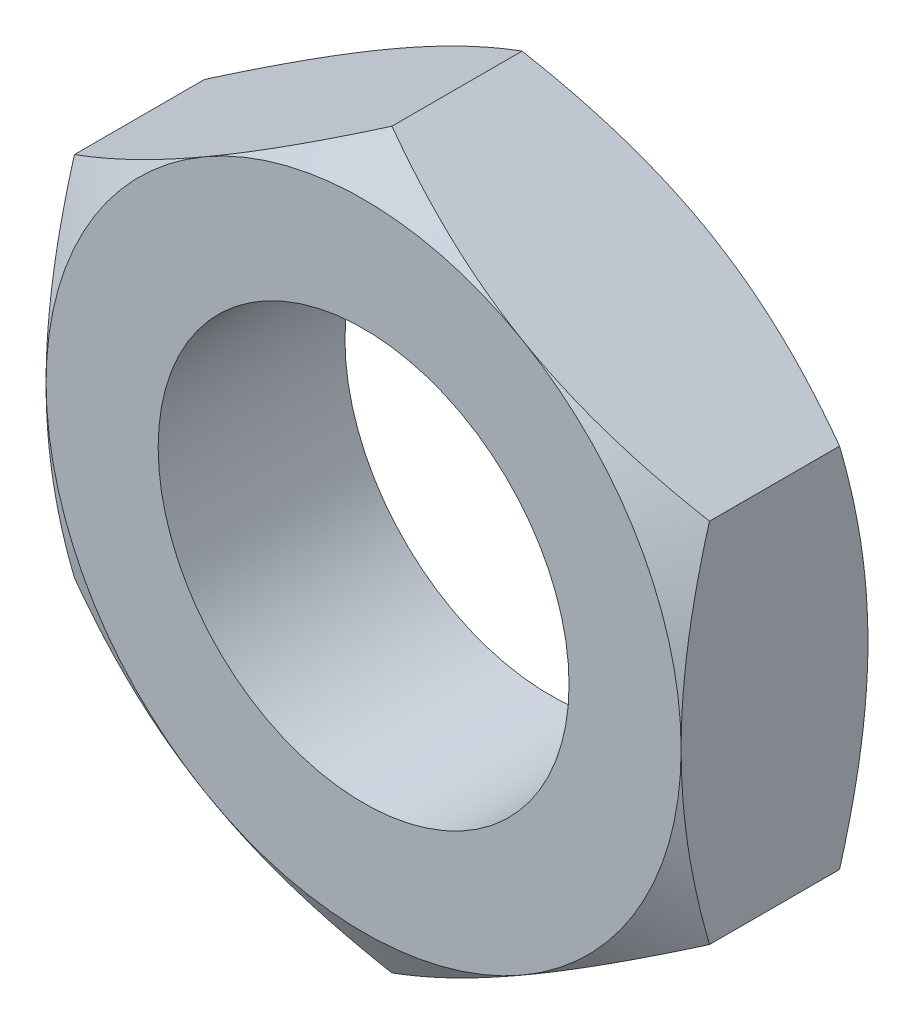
ISO-10303-21;
HEADER;
FILE_DESCRIPTION(('STEP AP214'),'2;1');
FILE_NAME('part.step','',(''),(''),'','','');
FILE_SCHEMA(('AUTOMOTIVE_DESIGN { 1 0 10303 214 1 1 1 1 }'));
ENDSEC;
DATA;
#1=APPLICATION_CONTEXT('core data for automotive mechanical design processes');
#2=APPLICATION_PROTOCOL_DEFINITION('international standard','automotive_design',2000,#1);
#3=PRODUCT_CONTEXT('',#1,'mechanical');
#4=PRODUCT('Part','Part','',(#3));
#5=PRODUCT_RELATED_PRODUCT_CATEGORY('part','',(#4));
#6=PRODUCT_DEFINITION_FORMATION('','',#4);
#7=PRODUCT_DEFINITION_CONTEXT('part definition',#1,'design');
#8=PRODUCT_DEFINITION('design','',#6,#7);
#9=PRODUCT_DEFINITION_SHAPE('','',#8);
#10=(LENGTH_UNIT() NAMED_UNIT(*) SI_UNIT(.MILLI.,.METRE.));
#11=(NAMED_UNIT(*) PLANE_ANGLE_UNIT() SI_UNIT($,.RADIAN.));
#12=(NAMED_UNIT(*) SI_UNIT($,.STERADIAN.) SOLID_ANGLE_UNIT());
#13=UNCERTAINTY_MEASURE_WITH_UNIT(LENGTH_MEASURE(1.E-05),#10,'distance_accuracy_value','');
#14=(GEOMETRIC_REPRESENTATION_CONTEXT(3) GLOBAL_UNCERTAINTY_ASSIGNED_CONTEXT((#13)) GLOBAL_UNIT_ASSIGNED_CONTEXT((#10,
#11,#12)) REPRESENTATION_CONTEXT('',''));
#15=CARTESIAN_POINT('',(0.,0.,0.));
#16=DIRECTION('',(0.,0.,1.));
#17=DIRECTION('',(1.,0.,0.));
#18=AXIS2_PLACEMENT_3D('',#15,#16,#17);
#19=CARTESIAN_POINT('',(-17.,29.4448637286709,0.));
#20=DIRECTION('',(0.,0.,-1.));
#21=DIRECTION('',(-1.,0.,0.));
#22=AXIS2_PLACEMENT_3D('',#19,#20,#21);
#23=PLANE('',#22);
#24=CARTESIAN_POINT('',(0.,0.,0.));
#25=DIRECTION('',(0.,0.,1.));
#26=DIRECTION('',(1.,0.,0.));
#27=AXIS2_PLACEMENT_3D('',#24,#25,#26);
#28=CIRCLE('',#27,11.);
#29=CARTESIAN_POINT('',(11.,0.,0.));
#30=VERTEX_POINT('',#29);
#31=EDGE_CURVE('E317',#30,#30,#28,.T.);
#32=ORIENTED_EDGE('',*,*,#31,.F.);
#33=EDGE_LOOP('',(#32));
#34=FACE_BOUND('',#33,.T.);
#35=CARTESIAN_POINT('',(0.,0.,0.));
#36=DIRECTION('',(0.,0.,-1.));
#37=DIRECTION('',(-1.,0.,0.));
#38=AXIS2_PLACEMENT_3D('',#35,#36,#37);
#39=CIRCLE('',#38,17.);
#40=CARTESIAN_POINT('',(-17.,0.,0.));
#41=VERTEX_POINT('',#40);
#42=CARTESIAN_POINT('',(-8.5,14.7224318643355,0.));
#43=VERTEX_POINT('',#42);
#44=EDGE_CURVE('E325',#41,#43,#39,.T.);
#45=ORIENTED_EDGE('',*,*,#44,.F.);
#46=CARTESIAN_POINT('',(0.,0.,0.));
#47=DIRECTION('',(0.,0.,-1.));
#48=DIRECTION('',(-1.,0.,0.));
#49=AXIS2_PLACEMENT_3D('',#46,#47,#48);
#50=CIRCLE('',#49,17.);
#51=CARTESIAN_POINT('',(-8.49999999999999,-14.7224318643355,0.));
#52=VERTEX_POINT('',#51);
#53=EDGE_CURVE('E147',#41,#52,#50,.F.);
#54=ORIENTED_EDGE('',*,*,#53,.T.);
#55=CARTESIAN_POINT('',(8.49999999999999,-14.7224318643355,0.));
#56=VERTEX_POINT('',#55);
#57=EDGE_CURVE('E249',#52,#56,#50,.F.);
#58=ORIENTED_EDGE('',*,*,#57,.T.);
#59=CARTESIAN_POINT('',(17.,0.,0.));
#60=VERTEX_POINT('',#59);
#61=EDGE_CURVE('E150',#56,#60,#50,.F.);
#62=ORIENTED_EDGE('',*,*,#61,.T.);
#63=CARTESIAN_POINT('',(8.49999999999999,14.7224318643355,0.));
#64=VERTEX_POINT('',#63);
#65=EDGE_CURVE('E125',#60,#64,#50,.F.);
#66=ORIENTED_EDGE('',*,*,#65,.T.);
#67=EDGE_CURVE('E138',#64,#43,#50,.F.);
#68=ORIENTED_EDGE('',*,*,#67,.T.);
#69=EDGE_LOOP('',(#45,#54,#58,#62,#66,#68));
#70=FACE_BOUND('',#69,.T.);
#71=ADVANCED_FACE('F30',(#34,#70),#23,.F.);
#72=CARTESIAN_POINT('',(0.,0.,0.));
#73=DIRECTION('',(0.,0.,-1.));
#74=DIRECTION('',(-1.,0.,0.));
#75=AXIS2_PLACEMENT_3D('',#72,#73,#74);
#76=CONICAL_SURFACE('',#75,17.,1.0471975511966);
#77=CARTESIAN_POINT('',(-17.,-26.5167226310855,-8.37053945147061));
#78=CARTESIAN_POINT('',(-17.,-26.144847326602,-8.18979610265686));
#79=CARTESIAN_POINT('',(-17.,-25.7725397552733,-8.00994255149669));
#80=CARTESIAN_POINT('',(-17.,-25.026969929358,-7.65221626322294));
#81=CARTESIAN_POINT('',(-17.,-24.6537076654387,-7.47434354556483));
#82=CARTESIAN_POINT('',(-17.,-23.5322563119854,-6.943952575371));
#83=CARTESIAN_POINT('',(-17.,-22.7825103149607,-6.5947139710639));
#84=CARTESIAN_POINT('',(-17.,-21.2740442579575,-5.90521759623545));
#85=CARTESIAN_POINT('',(-17.,-20.5152976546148,-5.56501775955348));
#86=CARTESIAN_POINT('',(-17.,-18.9918238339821,-4.8983317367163));
#87=CARTESIAN_POINT('',(-17.,-18.2270968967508,-4.57184491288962));
#88=CARTESIAN_POINT('',(-17.,-16.6651435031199,-3.92574204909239));
#89=CARTESIAN_POINT('',(-17.,-15.8676758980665,-3.6067059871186));
#90=CARTESIAN_POINT('',(-17.,-14.2634616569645,-2.99241108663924));
#91=CARTESIAN_POINT('',(-17.,-13.4567139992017,-2.69715489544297));
#92=CARTESIAN_POINT('',(-17.,-11.8341436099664,-2.13806404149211));
#93=CARTESIAN_POINT('',(-17.,-11.0183425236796,-1.87416705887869));
#94=CARTESIAN_POINT('',(-17.,-9.37496169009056,-1.38614627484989));
#95=CARTESIAN_POINT('',(-17.,-8.54738569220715,-1.16201010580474));
#96=CARTESIAN_POINT('',(-17.,-7.29934047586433,-0.864278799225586));
#97=CARTESIAN_POINT('',(-17.,-6.88338463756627,-0.771653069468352));
#98=CARTESIAN_POINT('',(-17.,-6.04860269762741,-0.600313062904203));
#99=CARTESIAN_POINT('',(-17.,-5.62977665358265,-0.521598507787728));
#100=CARTESIAN_POINT('',(-17.,-4.78953099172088,-0.379460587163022));
#101=CARTESIAN_POINT('',(-17.,-4.36811141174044,-0.316036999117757));
#102=CARTESIAN_POINT('',(-17.,-3.52311545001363,-0.205740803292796));
#103=CARTESIAN_POINT('',(-17.,-3.09953916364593,-0.158867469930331));
#104=CARTESIAN_POINT('',(-17.,-2.25641549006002,-0.0831987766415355));
#105=CARTESIAN_POINT('',(-17.,-1.83688896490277,-0.0541723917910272));
#106=CARTESIAN_POINT('',(-17.,-0.996984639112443,-0.013894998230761));
#107=CARTESIAN_POINT('',(-17.,-0.576606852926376,-0.00264369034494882));
#108=CARTESIAN_POINT('',(-17.,0.264248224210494,0.00181531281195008));
#109=CARTESIAN_POINT('',(-17.,0.684725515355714,-0.00497702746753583));
#110=CARTESIAN_POINT('',(-17.,1.52501565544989,-0.0364377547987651));
#111=CARTESIAN_POINT('',(-17.,1.9448284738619,-0.0611069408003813));
#112=CARTESIAN_POINT('',(-17.,2.94918965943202,-0.140982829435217));
#113=CARTESIAN_POINT('',(-17.,3.53309554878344,-0.204416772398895));
#114=CARTESIAN_POINT('',(-17.,4.69667719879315,-0.362449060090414));
#115=CARTESIAN_POINT('',(-17.,5.27635239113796,-0.457051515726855));
#116=CARTESIAN_POINT('',(-17.,6.4308850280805,-0.674055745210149));
#117=CARTESIAN_POINT('',(-17.,7.00573844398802,-0.796478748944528));
#118=CARTESIAN_POINT('',(-17.,8.14972965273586,-1.06537961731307));
#119=CARTESIAN_POINT('',(-17.,8.71886752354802,-1.21185715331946));
#120=CARTESIAN_POINT('',(-17.,9.86402806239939,-1.5287789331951));
#121=CARTESIAN_POINT('',(-17.,10.4399223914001,-1.69968370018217));
#122=CARTESIAN_POINT('',(-17.,11.5860401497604,-2.0594574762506));
#123=CARTESIAN_POINT('',(-17.,12.1562635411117,-2.24832660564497));
#124=CARTESIAN_POINT('',(-17.,13.2913158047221,-2.64100358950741));
#125=CARTESIAN_POINT('',(-17.,13.8561463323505,-2.84480668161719));
#126=CARTESIAN_POINT('',(-17.,14.9811068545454,-3.26492396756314));
#127=CARTESIAN_POINT('',(-17.,15.5412369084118,-3.48123800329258));
#128=CARTESIAN_POINT('',(-17.,16.879016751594,-4.01231538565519));
#129=CARTESIAN_POINT('',(-17.,17.6546888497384,-4.33205345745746));
#130=CARTESIAN_POINT('',(-17.,19.1992754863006,-4.98750305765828));
#131=CARTESIAN_POINT('',(-17.,19.9681895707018,-5.32321564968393));
#132=CARTESIAN_POINT('',(-17.,21.5005427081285,-6.00736484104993));
#133=CARTESIAN_POINT('',(-17.,22.2639803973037,-6.35580448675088));
#134=CARTESIAN_POINT('',(-17.,23.7861247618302,-7.06279709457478));
#135=CARTESIAN_POINT('',(-17.,24.5448315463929,-7.42134982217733));
#136=CARTESIAN_POINT('',(-17.,26.0591863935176,-8.14706783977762));
#137=CARTESIAN_POINT('',(-17.,26.8148299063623,-8.51424260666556));
#138=CARTESIAN_POINT('',(-17.,28.3228139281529,-9.25531244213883));
#139=CARTESIAN_POINT('',(-17.,29.0751544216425,-9.62920754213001));
#140=CARTESIAN_POINT('',(-17.,30.5769453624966,-10.382498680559));
#141=CARTESIAN_POINT('',(-17.,31.326396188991,-10.7618939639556));
#142=CARTESIAN_POINT('',(-17.,32.8229283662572,-11.525320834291));
#143=CARTESIAN_POINT('',(-17.,33.5700097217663,-11.9093524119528));
#144=CARTESIAN_POINT('',(-17.,35.6798855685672,-13.0008763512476));
#145=CARTESIAN_POINT('',(-17.,37.0403256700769,-13.7129194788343));
#146=CARTESIAN_POINT('',(-17.,39.7561499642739,-15.146684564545));
#147=CARTESIAN_POINT('',(-17.,41.1115339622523,-15.8684068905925));
#148=CARTESIAN_POINT('',(-17.,43.8148042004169,-17.3173473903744));
#149=CARTESIAN_POINT('',(-17.,45.1627007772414,-18.044546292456));
#150=CARTESIAN_POINT('',(-17.,47.1821687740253,-19.1396301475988));
#151=CARTESIAN_POINT('',(-17.,47.8549095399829,-19.5053618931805));
#152=CARTESIAN_POINT('',(-17.,49.1996896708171,-20.2381102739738));
#153=CARTESIAN_POINT('',(-17.,49.8717290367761,-20.6051269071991));
#154=CARTESIAN_POINT('',(-17.,50.5434577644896,-20.9727113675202));
#155=B_SPLINE_CURVE_WITH_KNOTS('',3,(#77,#78,#79,#80,#81,#82,#83,#84,#85,#86,#87,#88,#89,#90,
#91,#92,#93,#94,#95,#96,#97,#98,#99,#100,#101,#102,#103,#104,#105,#106,#107,#108,#109,#110,#111,
#112,#113,#114,#115,#116,#117,#118,#119,#120,#121,#122,#123,#124,#125,#126,#127,#128,#129,#130,
#131,#132,#133,#134,#135,#136,#137,#138,#139,#140,#141,#142,#143,#144,#145,#146,#147,#148,#149,
#150,#151,#152,#153,#154),.UNSPECIFIED.,.F.,.F.,(4,2,2,2,2,2,2,2,2,2,2,2,2,2,2,2,2,2,2,2,2,2,2,
2,2,2,2,2,2,2,2,2,2,2,2,2,2,2,4),(0.,1.24041490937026,2.48084199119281,4.96205540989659,
7.45652191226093,9.95087229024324,12.5273339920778,15.1040821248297,17.6756206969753,
20.2463579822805,21.5245952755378,22.8028069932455,24.0810001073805,25.3591371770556,
26.6203601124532,27.8815618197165,29.1427660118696,30.4040265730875,32.165079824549,
33.9263654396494,35.6889996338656,37.4516097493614,39.253415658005,41.0552336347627,
42.8564795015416,44.6577026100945,47.1744192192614,49.6913036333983,52.2087944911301,
54.7262270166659,57.2465696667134,59.7669240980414,62.2869357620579,64.8069423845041,
69.4134246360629,74.0200824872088,78.6147114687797,80.9118953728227,83.2090757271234),.UNSPECIFIED.);
#156=CARTESIAN_POINT('',(-17.,9.81495457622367,-1.51837875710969));
#157=VERTEX_POINT('',#156);
#158=EDGE_CURVE('E155',#157,#41,#155,.F.);
#159=ORIENTED_EDGE('',*,*,#158,.T.);
#160=ORIENTED_EDGE('',*,*,#44,.T.);
#161=CARTESIAN_POINT('',(0.0002,19.6300246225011,-1.51844542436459));
#162=CARTESIAN_POINT('',(-0.373453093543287,19.4142959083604,-1.39390284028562));
#163=CARTESIAN_POINT('',(-0.748563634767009,19.197725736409,-1.27501178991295));
#164=CARTESIAN_POINT('',(-1.50179265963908,18.7628487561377,-1.05010368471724));
#165=CARTESIAN_POINT('',(-1.87991208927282,18.5445414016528,-0.944090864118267));
#166=CARTESIAN_POINT('',(-2.63988968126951,18.1057681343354,-0.746364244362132));
#167=CARTESIAN_POINT('',(-3.02175449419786,17.8852983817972,-0.654684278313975));
#168=CARTESIAN_POINT('',(-3.78813752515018,17.4428269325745,-0.48759203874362));
#169=CARTESIAN_POINT('',(-4.1726555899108,17.2208253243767,-0.41217883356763));
#170=CARTESIAN_POINT('',(-4.93449246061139,16.7809786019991,-0.280827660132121));
#171=CARTESIAN_POINT('',(-5.31175470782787,16.5631661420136,-0.224454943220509));
#172=CARTESIAN_POINT('',(-6.06800787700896,16.1265431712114,-0.129930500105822));
#173=CARTESIAN_POINT('',(-6.44699883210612,15.9077326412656,-0.0917791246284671));
#174=CARTESIAN_POINT('',(-7.20561738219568,15.4697440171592,-0.0346606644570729));
#175=CARTESIAN_POINT('',(-7.58524368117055,15.2505666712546,-0.0156707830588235));
#176=CARTESIAN_POINT('',(-8.34484669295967,14.8120096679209,0.00271629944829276));
#177=CARTESIAN_POINT('',(-8.72482339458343,14.5926300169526,0.00211410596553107));
#178=CARTESIAN_POINT('',(-9.43519932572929,14.1824942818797,-0.0173147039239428));
#179=CARTESIAN_POINT('',(-9.76564916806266,13.9917089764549,-0.0337721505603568));
#180=CARTESIAN_POINT('',(-10.4257606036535,13.6105934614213,-0.0811925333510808));
#181=CARTESIAN_POINT('',(-10.7554222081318,13.4202632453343,-0.11215526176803));
#182=CARTESIAN_POINT('',(-11.4138322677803,13.0401300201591,-0.18804894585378));
#183=CARTESIAN_POINT('',(-11.7425796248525,12.8503276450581,-0.23299253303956));
#184=CARTESIAN_POINT('',(-12.3985093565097,12.4716264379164,-0.336054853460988));
#185=CARTESIAN_POINT('',(-12.7256917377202,12.2827276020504,-0.394173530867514));
#186=CARTESIAN_POINT('',(-13.718896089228,11.709300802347,-0.589770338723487));
#187=CARTESIAN_POINT('',(-14.3820418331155,11.3264334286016,-0.746752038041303));
#188=CARTESIAN_POINT('',(-15.6984451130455,10.5664076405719,-1.10303610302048));
#189=CARTESIAN_POINT('',(-16.351719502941,10.1892394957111,-1.30225479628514));
#190=CARTESIAN_POINT('',(-17.0002,9.81483910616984,-1.51844542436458));
#191=B_SPLINE_CURVE_WITH_KNOTS('',3,(#161,#162,#163,#164,#165,#166,#167,#168,#169,#170,#171,
#172,#173,#174,#175,#176,#177,#178,#179,#180,#181,#182,#183,#184,#185,#186,#187,#188,#189,#190),
.UNSPECIFIED.,.F.,.F.,(4,2,2,2,2,2,2,2,2,2,2,2,2,2,4),(0.,1.34725361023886,2.6949489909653,
4.04577911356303,5.39653184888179,6.71394507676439,8.03138366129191,9.3472530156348,
10.6630817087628,11.808581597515,12.9540650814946,14.1005865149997,15.2471030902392,
17.590639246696,19.929575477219),.UNSPECIFIED.);
#192=EDGE_CURVE('E187',#43,#157,#191,.T.);
#193=ORIENTED_EDGE('',*,*,#192,.T.);
#194=EDGE_LOOP('',(#159,#160,#193));
#195=FACE_BOUND('',#194,.T.);
#196=ADVANCED_FACE('F174',(#195),#76,.T.);
#197=CARTESIAN_POINT('',(17.0002,9.81483910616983,-1.51844542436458));
#198=CARTESIAN_POINT('',(16.6265469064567,10.0305678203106,-1.39390284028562));
#199=CARTESIAN_POINT('',(16.251436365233,10.247137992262,-1.27501178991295));
#200=CARTESIAN_POINT('',(15.4982073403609,10.6820149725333,-1.05010368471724));
#201=CARTESIAN_POINT('',(15.1200879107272,10.9003223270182,-0.944090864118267));
#202=CARTESIAN_POINT('',(14.3601103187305,11.3390955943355,-0.746364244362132));
#203=CARTESIAN_POINT('',(13.9782455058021,11.5595653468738,-0.654684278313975));
#204=CARTESIAN_POINT('',(13.2118624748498,12.0020367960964,-0.48759203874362));
#205=CARTESIAN_POINT('',(12.8273444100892,12.2240384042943,-0.412178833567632));
#206=CARTESIAN_POINT('',(12.0655075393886,12.6638851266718,-0.280827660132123));
#207=CARTESIAN_POINT('',(11.6882452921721,12.8816975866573,-0.22445494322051));
#208=CARTESIAN_POINT('',(10.931992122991,13.3183205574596,-0.129930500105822));
#209=CARTESIAN_POINT('',(10.5530011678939,13.5371310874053,-0.0917791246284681));
#210=CARTESIAN_POINT('',(9.79438261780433,13.9751197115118,-0.0346606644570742));
#211=CARTESIAN_POINT('',(9.41475631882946,14.1942970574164,-0.0156707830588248));
#212=CARTESIAN_POINT('',(8.65515330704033,14.6328540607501,0.00271629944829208));
#213=CARTESIAN_POINT('',(8.27517660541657,14.8522337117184,0.00211410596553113));
#214=CARTESIAN_POINT('',(7.56480067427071,15.2623694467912,-0.0173147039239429));
#215=CARTESIAN_POINT('',(7.23435083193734,15.4531547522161,-0.0337721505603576));
#216=CARTESIAN_POINT('',(6.57423939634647,15.8342702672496,-0.0811925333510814));
#217=CARTESIAN_POINT('',(6.24457779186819,16.0246004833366,-0.11215526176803));
#218=CARTESIAN_POINT('',(5.58616773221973,16.4047337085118,-0.18804894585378));
#219=CARTESIAN_POINT('',(5.25742037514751,16.5945360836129,-0.232992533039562));
#220=CARTESIAN_POINT('',(4.60149064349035,16.9732372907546,-0.33605485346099));
#221=CARTESIAN_POINT('',(4.27430826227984,17.1621361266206,-0.394173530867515));
#222=CARTESIAN_POINT('',(3.28110391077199,17.735562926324,-0.589770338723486));
#223=CARTESIAN_POINT('',(2.61795816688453,18.1184303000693,-0.746752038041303));
#224=CARTESIAN_POINT('',(1.30155488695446,18.8784560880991,-1.10303610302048));
#225=CARTESIAN_POINT('',(0.648280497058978,19.2556242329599,-1.30225479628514));
#226=CARTESIAN_POINT('',(-0.000199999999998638,19.6300246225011,-1.51844542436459));
#227=B_SPLINE_CURVE_WITH_KNOTS('',3,(#197,#198,#199,#200,#201,#202,#203,#204,#205,#206,#207,
#208,#209,#210,#211,#212,#213,#214,#215,#216,#217,#218,#219,#220,#221,#222,#223,#224,#225,#226),
.UNSPECIFIED.,.F.,.F.,(4,2,2,2,2,2,2,2,2,2,2,2,2,2,4),(0.,1.34725361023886,2.6949489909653,
4.04577911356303,5.39653184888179,6.71394507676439,8.03138366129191,9.3472530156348,
10.6630817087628,11.808581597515,12.9540650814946,14.1005865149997,15.2471030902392,
17.590639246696,19.929575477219),.UNSPECIFIED.);
#228=CARTESIAN_POINT('',(0.,19.6299091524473,-1.51837875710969));
#229=VERTEX_POINT('',#228);
#230=EDGE_CURVE('E134',#64,#229,#227,.T.);
#231=ORIENTED_EDGE('',*,*,#230,.T.);
#232=EDGE_CURVE('E141',#229,#43,#191,.T.);
#233=ORIENTED_EDGE('',*,*,#232,.T.);
#234=ORIENTED_EDGE('',*,*,#67,.F.);
#235=EDGE_LOOP('',(#231,#233,#234));
#236=FACE_BOUND('',#235,.T.);
#237=ADVANCED_FACE('F139',(#236),#76,.T.);
#238=CARTESIAN_POINT('',(17.,-26.5167226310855,-8.37053945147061));
#239=CARTESIAN_POINT('',(17.,-26.144847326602,-8.18979610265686));
#240=CARTESIAN_POINT('',(17.,-25.7725397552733,-8.00994255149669));
#241=CARTESIAN_POINT('',(17.,-25.026969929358,-7.65221626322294));
#242=CARTESIAN_POINT('',(17.,-24.6537076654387,-7.47434354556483));
#243=CARTESIAN_POINT('',(17.,-23.5322563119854,-6.943952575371));
#244=CARTESIAN_POINT('',(17.,-22.7825103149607,-6.5947139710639));
#245=CARTESIAN_POINT('',(17.,-21.2740442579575,-5.90521759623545));
#246=CARTESIAN_POINT('',(17.,-20.5152976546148,-5.56501775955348));
#247=CARTESIAN_POINT('',(17.,-18.9918238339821,-4.8983317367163));
#248=CARTESIAN_POINT('',(17.,-18.2270968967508,-4.57184491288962));
#249=CARTESIAN_POINT('',(17.,-16.6651435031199,-3.92574204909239));
#250=CARTESIAN_POINT('',(17.,-15.8676758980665,-3.6067059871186));
#251=CARTESIAN_POINT('',(17.,-14.2634616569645,-2.99241108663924));
#252=CARTESIAN_POINT('',(17.,-13.4567139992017,-2.69715489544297));
#253=CARTESIAN_POINT('',(17.,-11.8341436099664,-2.13806404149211));
#254=CARTESIAN_POINT('',(17.,-11.0183425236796,-1.87416705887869));
#255=CARTESIAN_POINT('',(17.,-9.37496169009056,-1.38614627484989));
#256=CARTESIAN_POINT('',(17.,-8.54738569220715,-1.16201010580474));
#257=CARTESIAN_POINT('',(17.,-7.29934047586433,-0.864278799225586));
#258=CARTESIAN_POINT('',(17.,-6.88338463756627,-0.771653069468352));
#259=CARTESIAN_POINT('',(17.,-6.04860269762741,-0.600313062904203));
#260=CARTESIAN_POINT('',(17.,-5.62977665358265,-0.521598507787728));
#261=CARTESIAN_POINT('',(17.,-4.78953099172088,-0.379460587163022));
#262=CARTESIAN_POINT('',(17.,-4.36811141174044,-0.316036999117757));
#263=CARTESIAN_POINT('',(17.,-3.52311545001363,-0.205740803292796));
#264=CARTESIAN_POINT('',(17.,-3.09953916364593,-0.158867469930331));
#265=CARTESIAN_POINT('',(17.,-2.25641549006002,-0.0831987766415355));
#266=CARTESIAN_POINT('',(17.,-1.83688896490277,-0.0541723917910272));
#267=CARTESIAN_POINT('',(17.,-0.996984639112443,-0.013894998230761));
#268=CARTESIAN_POINT('',(17.,-0.576606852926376,-0.00264369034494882));
#269=CARTESIAN_POINT('',(17.,0.264248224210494,0.00181531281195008));
#270=CARTESIAN_POINT('',(17.,0.684725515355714,-0.00497702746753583));
#271=CARTESIAN_POINT('',(17.,1.52501565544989,-0.0364377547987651));
#272=CARTESIAN_POINT('',(17.,1.9448284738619,-0.0611069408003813));
#273=CARTESIAN_POINT('',(17.,2.94918965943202,-0.140982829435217));
#274=CARTESIAN_POINT('',(17.,3.53309554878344,-0.204416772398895));
#275=CARTESIAN_POINT('',(17.,4.69667719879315,-0.362449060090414));
#276=CARTESIAN_POINT('',(17.,5.27635239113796,-0.457051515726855));
#277=CARTESIAN_POINT('',(17.,6.4308850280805,-0.674055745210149));
#278=CARTESIAN_POINT('',(17.,7.00573844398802,-0.796478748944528));
#279=CARTESIAN_POINT('',(17.,8.14972965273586,-1.06537961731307));
#280=CARTESIAN_POINT('',(17.,8.71886752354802,-1.21185715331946));
#281=CARTESIAN_POINT('',(17.,9.86402806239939,-1.5287789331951));
#282=CARTESIAN_POINT('',(17.,10.4399223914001,-1.69968370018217));
#283=CARTESIAN_POINT('',(17.,11.5860401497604,-2.0594574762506));
#284=CARTESIAN_POINT('',(17.,12.1562635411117,-2.24832660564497));
#285=CARTESIAN_POINT('',(17.,13.2913158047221,-2.64100358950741));
#286=CARTESIAN_POINT('',(17.,13.8561463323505,-2.84480668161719));
#287=CARTESIAN_POINT('',(17.,14.9811068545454,-3.26492396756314));
#288=CARTESIAN_POINT('',(17.,15.5412369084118,-3.48123800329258));
#289=CARTESIAN_POINT('',(17.,16.879016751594,-4.01231538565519));
#290=CARTESIAN_POINT('',(17.,17.6546888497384,-4.33205345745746));
#291=CARTESIAN_POINT('',(17.,19.1992754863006,-4.98750305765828));
#292=CARTESIAN_POINT('',(17.,19.9681895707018,-5.32321564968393));
#293=CARTESIAN_POINT('',(17.,21.5005427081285,-6.00736484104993));
#294=CARTESIAN_POINT('',(17.,22.2639803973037,-6.35580448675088));
#295=CARTESIAN_POINT('',(17.,23.7861247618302,-7.06279709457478));
#296=CARTESIAN_POINT('',(17.,24.5448315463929,-7.42134982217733));
#297=CARTESIAN_POINT('',(17.,26.0591863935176,-8.14706783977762));
#298=CARTESIAN_POINT('',(17.,26.8148299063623,-8.51424260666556));
#299=CARTESIAN_POINT('',(17.,28.3228139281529,-9.25531244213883));
#300=CARTESIAN_POINT('',(17.,29.0751544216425,-9.62920754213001));
#301=CARTESIAN_POINT('',(17.,30.5769453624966,-10.382498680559));
#302=CARTESIAN_POINT('',(17.,31.326396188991,-10.7618939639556));
#303=CARTESIAN_POINT('',(17.,32.8229283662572,-11.525320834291));
#304=CARTESIAN_POINT('',(17.,33.5700097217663,-11.9093524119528));
#305=CARTESIAN_POINT('',(17.,35.6798855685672,-13.0008763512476));
#306=CARTESIAN_POINT('',(17.,37.0403256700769,-13.7129194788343));
#307=CARTESIAN_POINT('',(17.,39.7561499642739,-15.146684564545));
#308=CARTESIAN_POINT('',(17.,41.1115339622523,-15.8684068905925));
#309=CARTESIAN_POINT('',(17.,43.8148042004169,-17.3173473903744));
#310=CARTESIAN_POINT('',(17.,45.1627007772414,-18.044546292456));
#311=CARTESIAN_POINT('',(17.,47.1821687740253,-19.1396301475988));
#312=CARTESIAN_POINT('',(17.,47.8549095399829,-19.5053618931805));
#313=CARTESIAN_POINT('',(17.,49.1996896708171,-20.2381102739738));
#314=CARTESIAN_POINT('',(17.,49.8717290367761,-20.6051269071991));
#315=CARTESIAN_POINT('',(17.,50.5434577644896,-20.9727113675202));
#316=B_SPLINE_CURVE_WITH_KNOTS('',3,(#238,#239,#240,#241,#242,#243,#244,#245,#246,#247,#248,
#249,#250,#251,#252,#253,#254,#255,#256,#257,#258,#259,#260,#261,#262,#263,#264,#265,#266,#267,
#268,#269,#270,#271,#272,#273,#274,#275,#276,#277,#278,#279,#280,#281,#282,#283,#284,#285,#286,
#287,#288,#289,#290,#291,#292,#293,#294,#295,#296,#297,#298,#299,#300,#301,#302,#303,#304,#305,
#306,#307,#308,#309,#310,#311,#312,#313,#314,#315),.UNSPECIFIED.,.F.,.F.,(4,2,2,2,2,2,2,2,2,2,2,
2,2,2,2,2,2,2,2,2,2,2,2,2,2,2,2,2,2,2,2,2,2,2,2,2,2,2,4),(0.,1.24041490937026,2.48084199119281,
4.96205540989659,7.45652191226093,9.95087229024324,12.5273339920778,15.1040821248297,
17.6756206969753,20.2463579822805,21.5245952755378,22.8028069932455,24.0810001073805,
25.3591371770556,26.6203601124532,27.8815618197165,29.1427660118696,30.4040265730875,
32.165079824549,33.9263654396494,35.6889996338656,37.4516097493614,39.253415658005,
41.0552336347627,42.8564795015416,44.6577026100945,47.1744192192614,49.6913036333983,
52.2087944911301,54.7262270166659,57.2465696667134,59.7669240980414,62.2869357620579,
64.8069423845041,69.4134246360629,74.0200824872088,78.6147114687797,80.9118953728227,
83.2090757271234),.UNSPECIFIED.);
#317=CARTESIAN_POINT('',(17.,9.81495457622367,-1.51837875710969));
#318=VERTEX_POINT('',#317);
#319=EDGE_CURVE('E128',#60,#318,#316,.T.);
#320=ORIENTED_EDGE('',*,*,#319,.T.);
#321=EDGE_CURVE('E121',#318,#64,#227,.T.);
#322=ORIENTED_EDGE('',*,*,#321,.T.);
#323=ORIENTED_EDGE('',*,*,#65,.F.);
#324=EDGE_LOOP('',(#320,#322,#323));
#325=FACE_BOUND('',#324,.T.);
#326=ADVANCED_FACE('F123',(#325),#76,.T.);
#327=CARTESIAN_POINT('',(-0.0002,-19.6300246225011,-1.51844542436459));
#328=CARTESIAN_POINT('',(0.373453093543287,-19.4142959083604,-1.39390284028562));
#329=CARTESIAN_POINT('',(0.748563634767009,-19.197725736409,-1.27501178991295));
#330=CARTESIAN_POINT('',(1.50179265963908,-18.7628487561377,-1.05010368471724));
#331=CARTESIAN_POINT('',(1.87991208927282,-18.5445414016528,-0.944090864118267));
#332=CARTESIAN_POINT('',(2.63988968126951,-18.1057681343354,-0.746364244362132));
#333=CARTESIAN_POINT('',(3.02175449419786,-17.8852983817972,-0.654684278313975));
#334=CARTESIAN_POINT('',(3.78813752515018,-17.4428269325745,-0.48759203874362));
#335=CARTESIAN_POINT('',(4.1726555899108,-17.2208253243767,-0.41217883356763));
#336=CARTESIAN_POINT('',(4.93449246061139,-16.7809786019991,-0.280827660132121));
#337=CARTESIAN_POINT('',(5.31175470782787,-16.5631661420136,-0.224454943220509));
#338=CARTESIAN_POINT('',(6.06800787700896,-16.1265431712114,-0.129930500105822));
#339=CARTESIAN_POINT('',(6.44699883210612,-15.9077326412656,-0.0917791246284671));
#340=CARTESIAN_POINT('',(7.20561738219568,-15.4697440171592,-0.0346606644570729));
#341=CARTESIAN_POINT('',(7.58524368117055,-15.2505666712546,-0.0156707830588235));
#342=CARTESIAN_POINT('',(8.34484669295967,-14.8120096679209,0.00271629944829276));
#343=CARTESIAN_POINT('',(8.72482339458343,-14.5926300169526,0.00211410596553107));
#344=CARTESIAN_POINT('',(9.43519932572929,-14.1824942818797,-0.0173147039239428));
#345=CARTESIAN_POINT('',(9.76564916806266,-13.9917089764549,-0.0337721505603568));
#346=CARTESIAN_POINT('',(10.4257606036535,-13.6105934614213,-0.0811925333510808));
#347=CARTESIAN_POINT('',(10.7554222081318,-13.4202632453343,-0.11215526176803));
#348=CARTESIAN_POINT('',(11.4138322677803,-13.0401300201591,-0.18804894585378));
#349=CARTESIAN_POINT('',(11.7425796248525,-12.8503276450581,-0.23299253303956));
#350=CARTESIAN_POINT('',(12.3985093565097,-12.4716264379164,-0.336054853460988));
#351=CARTESIAN_POINT('',(12.7256917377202,-12.2827276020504,-0.394173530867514));
#352=CARTESIAN_POINT('',(13.718896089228,-11.709300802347,-0.589770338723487));
#353=CARTESIAN_POINT('',(14.3820418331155,-11.3264334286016,-0.746752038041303));
#354=CARTESIAN_POINT('',(15.6984451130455,-10.5664076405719,-1.10303610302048));
#355=CARTESIAN_POINT('',(16.351719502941,-10.1892394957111,-1.30225479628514));
#356=CARTESIAN_POINT('',(17.0002,-9.81483910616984,-1.51844542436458));
#357=B_SPLINE_CURVE_WITH_KNOTS('',3,(#327,#328,#329,#330,#331,#332,#333,#334,#335,#336,#337,
#338,#339,#340,#341,#342,#343,#344,#345,#346,#347,#348,#349,#350,#351,#352,#353,#354,#355,#356),
.UNSPECIFIED.,.F.,.F.,(4,2,2,2,2,2,2,2,2,2,2,2,2,2,4),(0.,1.34725361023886,2.6949489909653,
4.04577911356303,5.39653184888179,6.71394507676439,8.03138366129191,9.3472530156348,
10.6630817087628,11.808581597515,12.9540650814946,14.1005865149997,15.2471030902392,
17.590639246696,19.929575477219),.UNSPECIFIED.);
#358=CARTESIAN_POINT('',(17.,-9.81495457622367,-1.51837875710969));
#359=VERTEX_POINT('',#358);
#360=EDGE_CURVE('E201',#56,#359,#357,.T.);
#361=ORIENTED_EDGE('',*,*,#360,.T.);
#362=EDGE_CURVE('E200',#359,#60,#316,.T.);
#363=ORIENTED_EDGE('',*,*,#362,.T.);
#364=ORIENTED_EDGE('',*,*,#61,.F.);
#365=EDGE_LOOP('',(#361,#363,#364));
#366=FACE_BOUND('',#365,.T.);
#367=ADVANCED_FACE('F425',(#366),#76,.T.);
#368=CARTESIAN_POINT('',(0.,-19.6299091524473,-1.51837875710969));
#369=VERTEX_POINT('',#368);
#370=EDGE_CURVE('E259',#369,#56,#357,.T.);
#371=ORIENTED_EDGE('',*,*,#370,.T.);
#372=ORIENTED_EDGE('',*,*,#57,.F.);
#373=CARTESIAN_POINT('',(-17.0002,-9.81483910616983,-1.51844542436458));
#374=CARTESIAN_POINT('',(-16.6265469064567,-10.0305678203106,-1.39390284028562));
#375=CARTESIAN_POINT('',(-16.251436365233,-10.247137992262,-1.27501178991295));
#376=CARTESIAN_POINT('',(-15.4982073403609,-10.6820149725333,-1.05010368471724));
#377=CARTESIAN_POINT('',(-15.1200879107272,-10.9003223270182,-0.944090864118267));
#378=CARTESIAN_POINT('',(-14.3601103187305,-11.3390955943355,-0.746364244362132));
#379=CARTESIAN_POINT('',(-13.9782455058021,-11.5595653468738,-0.654684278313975));
#380=CARTESIAN_POINT('',(-13.2118624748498,-12.0020367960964,-0.48759203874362));
#381=CARTESIAN_POINT('',(-12.8273444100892,-12.2240384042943,-0.412178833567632));
#382=CARTESIAN_POINT('',(-12.0655075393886,-12.6638851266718,-0.280827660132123));
#383=CARTESIAN_POINT('',(-11.6882452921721,-12.8816975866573,-0.22445494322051));
#384=CARTESIAN_POINT('',(-10.931992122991,-13.3183205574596,-0.129930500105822));
#385=CARTESIAN_POINT('',(-10.5530011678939,-13.5371310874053,-0.0917791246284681));
#386=CARTESIAN_POINT('',(-9.79438261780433,-13.9751197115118,-0.0346606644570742));
#387=CARTESIAN_POINT('',(-9.41475631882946,-14.1942970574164,-0.0156707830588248));
#388=CARTESIAN_POINT('',(-8.65515330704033,-14.6328540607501,0.00271629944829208));
#389=CARTESIAN_POINT('',(-8.27517660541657,-14.8522337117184,0.00211410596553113));
#390=CARTESIAN_POINT('',(-7.56480067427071,-15.2623694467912,-0.0173147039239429));
#391=CARTESIAN_POINT('',(-7.23435083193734,-15.4531547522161,-0.0337721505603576));
#392=CARTESIAN_POINT('',(-6.57423939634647,-15.8342702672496,-0.0811925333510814));
#393=CARTESIAN_POINT('',(-6.24457779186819,-16.0246004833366,-0.11215526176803));
#394=CARTESIAN_POINT('',(-5.58616773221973,-16.4047337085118,-0.18804894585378));
#395=CARTESIAN_POINT('',(-5.25742037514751,-16.5945360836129,-0.232992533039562));
#396=CARTESIAN_POINT('',(-4.60149064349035,-16.9732372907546,-0.33605485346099));
#397=CARTESIAN_POINT('',(-4.27430826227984,-17.1621361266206,-0.394173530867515));
#398=CARTESIAN_POINT('',(-3.28110391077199,-17.735562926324,-0.589770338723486));
#399=CARTESIAN_POINT('',(-2.61795816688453,-18.1184303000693,-0.746752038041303));
#400=CARTESIAN_POINT('',(-1.30155488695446,-18.8784560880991,-1.10303610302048));
#401=CARTESIAN_POINT('',(-0.648280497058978,-19.2556242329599,-1.30225479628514));
#402=CARTESIAN_POINT('',(0.000199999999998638,-19.6300246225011,-1.51844542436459));
#403=B_SPLINE_CURVE_WITH_KNOTS('',3,(#373,#374,#375,#376,#377,#378,#379,#380,#381,#382,#383,
#384,#385,#386,#387,#388,#389,#390,#391,#392,#393,#394,#395,#396,#397,#398,#399,#400,#401,#402),
.UNSPECIFIED.,.F.,.F.,(4,2,2,2,2,2,2,2,2,2,2,2,2,2,4),(0.,1.34725361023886,2.6949489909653,
4.04577911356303,5.39653184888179,6.71394507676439,8.03138366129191,9.3472530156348,
10.6630817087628,11.808581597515,12.9540650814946,14.1005865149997,15.2471030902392,
17.590639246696,19.929575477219),.UNSPECIFIED.);
#404=EDGE_CURVE('E263',#52,#369,#403,.T.);
#405=ORIENTED_EDGE('',*,*,#404,.T.);
#406=EDGE_LOOP('',(#371,#372,#405));
#407=FACE_BOUND('',#406,.T.);
#408=ADVANCED_FACE('F180',(#407),#76,.T.);
#409=CARTESIAN_POINT('',(-17.,-9.81495457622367,-1.51837875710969));
#410=VERTEX_POINT('',#409);
#411=EDGE_CURVE('E168',#410,#52,#403,.T.);
#412=ORIENTED_EDGE('',*,*,#411,.T.);
#413=ORIENTED_EDGE('',*,*,#53,.F.);
#414=EDGE_CURVE('E133',#41,#410,#155,.F.);
#415=ORIENTED_EDGE('',*,*,#414,.T.);
#416=EDGE_LOOP('',(#412,#413,#415));
#417=FACE_BOUND('',#416,.T.);
#418=ADVANCED_FACE('F268',(#417),#76,.T.);
#419=CARTESIAN_POINT('',(17.,9.81495457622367,-10.));
#420=DIRECTION('',(0.499999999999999,0.866025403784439,0.));
#421=DIRECTION('',(-0.866025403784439,0.499999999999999,0.));
#422=AXIS2_PLACEMENT_3D('',#419,#420,#421);
#423=PLANE('',#422);
#424=CARTESIAN_POINT('',(-0.0002,19.6300246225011,-8.48155457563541));
#425=CARTESIAN_POINT('',(0.373453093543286,19.4142959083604,-8.60609715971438));
#426=CARTESIAN_POINT('',(0.748563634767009,19.197725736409,-8.72498821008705));
#427=CARTESIAN_POINT('',(1.50179265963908,18.7628487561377,-8.94989631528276));
#428=CARTESIAN_POINT('',(1.87991208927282,18.5445414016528,-9.05590913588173));
#429=CARTESIAN_POINT('',(2.63988968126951,18.1057681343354,-9.25363575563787));
#430=CARTESIAN_POINT('',(3.02175449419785,17.8852983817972,-9.34531572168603));
#431=CARTESIAN_POINT('',(3.78813752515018,17.4428269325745,-9.51240796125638));
#432=CARTESIAN_POINT('',(4.1726555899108,17.2208253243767,-9.58782116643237));
#433=CARTESIAN_POINT('',(4.93449246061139,16.7809786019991,-9.71917233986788));
#434=CARTESIAN_POINT('',(5.31175470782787,16.5631661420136,-9.77554505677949));
#435=CARTESIAN_POINT('',(6.06800787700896,16.1265431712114,-9.87006949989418));
#436=CARTESIAN_POINT('',(6.44699883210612,15.9077326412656,-9.90822087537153));
#437=CARTESIAN_POINT('',(7.20561738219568,15.4697440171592,-9.96533933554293));
#438=CARTESIAN_POINT('',(7.58524368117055,15.2505666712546,-9.98432921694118));
#439=CARTESIAN_POINT('',(8.34484669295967,14.8120096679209,-10.0027162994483));
#440=CARTESIAN_POINT('',(8.72482339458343,14.5926300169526,-10.0021141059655));
#441=CARTESIAN_POINT('',(9.43519932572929,14.1824942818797,-9.98268529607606));
#442=CARTESIAN_POINT('',(9.76564916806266,13.9917089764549,-9.96622784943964));
#443=CARTESIAN_POINT('',(10.4257606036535,13.6105934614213,-9.91880746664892));
#444=CARTESIAN_POINT('',(10.7554222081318,13.4202632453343,-9.88784473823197));
#445=CARTESIAN_POINT('',(11.4138322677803,13.0401300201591,-9.81195105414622));
#446=CARTESIAN_POINT('',(11.7425796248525,12.8503276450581,-9.76700746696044));
#447=CARTESIAN_POINT('',(12.3985093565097,12.4716264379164,-9.66394514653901));
#448=CARTESIAN_POINT('',(12.7256917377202,12.2827276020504,-9.60582646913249));
#449=CARTESIAN_POINT('',(13.718896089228,11.709300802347,-9.41022966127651));
#450=CARTESIAN_POINT('',(14.3820418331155,11.3264334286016,-9.2532479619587));
#451=CARTESIAN_POINT('',(15.6984451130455,10.5664076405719,-8.89696389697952));
#452=CARTESIAN_POINT('',(16.351719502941,10.1892394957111,-8.69774520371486));
#453=CARTESIAN_POINT('',(17.0002,9.81483910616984,-8.48155457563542));
#454=B_SPLINE_CURVE_WITH_KNOTS('',3,(#424,#425,#426,#427,#428,#429,#430,#431,#432,#433,#434,
#435,#436,#437,#438,#439,#440,#441,#442,#443,#444,#445,#446,#447,#448,#449,#450,#451,#452,#453),
.UNSPECIFIED.,.F.,.F.,(4,2,2,2,2,2,2,2,2,2,2,2,2,2,4),(0.,1.34725361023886,2.6949489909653,
4.04577911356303,5.3965318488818,6.71394507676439,8.03138366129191,9.3472530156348,
10.6630817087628,11.808581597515,12.9540650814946,14.1005865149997,15.2471030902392,
17.590639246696,19.929575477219),.UNSPECIFIED.);
#455=CARTESIAN_POINT('',(0.,19.6299091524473,-8.48162124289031));
#456=VERTEX_POINT('',#455);
#457=CARTESIAN_POINT('',(8.49999999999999,14.7224318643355,-10.));
#458=VERTEX_POINT('',#457);
#459=EDGE_CURVE('E234',#456,#458,#454,.T.);
#460=ORIENTED_EDGE('',*,*,#459,.F.);
#461=DIRECTION('',(0.,0.,1.));
#462=VECTOR('',#461,1.);
#463=CARTESIAN_POINT('',(0.,19.6299091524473,-10.));
#464=LINE('',#463,#462);
#465=EDGE_CURVE('E154',#456,#229,#464,.T.);
#466=ORIENTED_EDGE('',*,*,#465,.T.);
#467=ORIENTED_EDGE('',*,*,#230,.F.);
#468=ORIENTED_EDGE('',*,*,#321,.F.);
#469=DIRECTION('',(0.,0.,1.));
#470=VECTOR('',#469,1.);
#471=CARTESIAN_POINT('',(17.,9.81495457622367,-10.));
#472=LINE('',#471,#470);
#473=CARTESIAN_POINT('',(17.,9.81495457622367,-8.48162124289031));
#474=VERTEX_POINT('',#473);
#475=EDGE_CURVE('E146',#474,#318,#472,.T.);
#476=ORIENTED_EDGE('',*,*,#475,.F.);
#477=EDGE_CURVE('E229',#458,#474,#454,.T.);
#478=ORIENTED_EDGE('',*,*,#477,.F.);
#479=EDGE_LOOP('',(#460,#466,#467,#468,#476,#478));
#480=FACE_BOUND('',#479,.T.);
#481=ADVANCED_FACE('F32',(#480),#423,.T.);
#482=CARTESIAN_POINT('',(17.,-9.81495457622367,-10.));
#483=DIRECTION('',(1.,0.,0.));
#484=DIRECTION('',(0.,0.,-1.));
#485=AXIS2_PLACEMENT_3D('',#482,#483,#484);
#486=PLANE('',#485);
#487=CARTESIAN_POINT('',(17.,-26.5167226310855,-1.62946054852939));
#488=CARTESIAN_POINT('',(17.,-26.144847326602,-1.81020389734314));
#489=CARTESIAN_POINT('',(17.,-25.7725397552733,-1.99005744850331));
#490=CARTESIAN_POINT('',(17.,-25.026969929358,-2.34778373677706));
#491=CARTESIAN_POINT('',(17.,-24.6537076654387,-2.52565645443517));
#492=CARTESIAN_POINT('',(17.,-23.5322563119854,-3.056047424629));
#493=CARTESIAN_POINT('',(17.,-22.7825103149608,-3.4052860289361));
#494=CARTESIAN_POINT('',(17.,-21.2740442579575,-4.09478240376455));
#495=CARTESIAN_POINT('',(17.,-20.5152976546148,-4.43498224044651));
#496=CARTESIAN_POINT('',(17.,-18.9918238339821,-5.1016682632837));
#497=CARTESIAN_POINT('',(17.,-18.2270968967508,-5.42815508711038));
#498=CARTESIAN_POINT('',(17.,-16.66514350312,-6.07425795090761));
#499=CARTESIAN_POINT('',(17.,-15.8676758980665,-6.39329401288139));
#500=CARTESIAN_POINT('',(17.,-14.2634616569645,-7.00758891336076));
#501=CARTESIAN_POINT('',(17.,-13.4567139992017,-7.30284510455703));
#502=CARTESIAN_POINT('',(17.,-11.8341436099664,-7.86193595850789));
#503=CARTESIAN_POINT('',(17.,-11.0183425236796,-8.12583294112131));
#504=CARTESIAN_POINT('',(17.,-9.37496169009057,-8.61385372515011));
#505=CARTESIAN_POINT('',(17.,-8.54738569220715,-8.83798989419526));
#506=CARTESIAN_POINT('',(17.,-7.29934047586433,-9.13572120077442));
#507=CARTESIAN_POINT('',(17.,-6.88338463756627,-9.22834693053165));
#508=CARTESIAN_POINT('',(17.,-6.04860269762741,-9.3996869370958));
#509=CARTESIAN_POINT('',(17.,-5.62977665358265,-9.47840149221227));
#510=CARTESIAN_POINT('',(17.,-4.78953099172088,-9.62053941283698));
#511=CARTESIAN_POINT('',(17.,-4.36811141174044,-9.68396300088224));
#512=CARTESIAN_POINT('',(17.,-3.52311545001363,-9.79425919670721));
#513=CARTESIAN_POINT('',(17.,-3.09953916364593,-9.84113253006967));
#514=CARTESIAN_POINT('',(17.,-2.25641549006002,-9.91680122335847));
#515=CARTESIAN_POINT('',(17.,-1.83688896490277,-9.94582760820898));
#516=CARTESIAN_POINT('',(17.,-0.996984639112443,-9.98610500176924));
#517=CARTESIAN_POINT('',(17.,-0.576606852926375,-9.99735630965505));
#518=CARTESIAN_POINT('',(17.,0.264248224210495,-10.001815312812));
#519=CARTESIAN_POINT('',(17.,0.684725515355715,-9.99502297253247));
#520=CARTESIAN_POINT('',(17.,1.52501565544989,-9.96356224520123));
#521=CARTESIAN_POINT('',(17.,1.9448284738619,-9.93889305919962));
#522=CARTESIAN_POINT('',(17.,2.94918965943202,-9.85901717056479));
#523=CARTESIAN_POINT('',(17.,3.53309554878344,-9.79558322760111));
#524=CARTESIAN_POINT('',(17.,4.69667719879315,-9.63755093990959));
#525=CARTESIAN_POINT('',(17.,5.27635239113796,-9.54294848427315));
#526=CARTESIAN_POINT('',(17.,6.4308850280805,-9.32594425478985));
#527=CARTESIAN_POINT('',(17.,7.00573844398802,-9.20352125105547));
#528=CARTESIAN_POINT('',(17.,8.14972965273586,-8.93462038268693));
#529=CARTESIAN_POINT('',(17.,8.71886752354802,-8.78814284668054));
#530=CARTESIAN_POINT('',(17.,9.86402806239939,-8.47122106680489));
#531=CARTESIAN_POINT('',(17.,10.4399223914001,-8.30031629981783));
#532=CARTESIAN_POINT('',(17.,11.5860401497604,-7.9405425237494));
#533=CARTESIAN_POINT('',(17.,12.1562635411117,-7.75167339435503));
#534=CARTESIAN_POINT('',(17.,13.2913158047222,-7.35899641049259));
#535=CARTESIAN_POINT('',(17.,13.8561463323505,-7.15519331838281));
#536=CARTESIAN_POINT('',(17.,14.9811068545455,-6.73507603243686));
#537=CARTESIAN_POINT('',(17.,15.5412369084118,-6.51876199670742));
#538=CARTESIAN_POINT('',(17.,16.879016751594,-5.9876846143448));
#539=CARTESIAN_POINT('',(17.,17.6546888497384,-5.66794654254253));
#540=CARTESIAN_POINT('',(17.,19.1992754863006,-5.01249694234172));
#541=CARTESIAN_POINT('',(17.,19.9681895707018,-4.67678435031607));
#542=CARTESIAN_POINT('',(17.,21.5005427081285,-3.99263515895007));
#543=CARTESIAN_POINT('',(17.,22.2639803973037,-3.64419551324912));
#544=CARTESIAN_POINT('',(17.,23.7861247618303,-2.93720290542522));
#545=CARTESIAN_POINT('',(17.,24.5448315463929,-2.57865017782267));
#546=CARTESIAN_POINT('',(17.,26.0591863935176,-1.85293216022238));
#547=CARTESIAN_POINT('',(17.,26.8148299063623,-1.48575739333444));
#548=CARTESIAN_POINT('',(17.,28.3228139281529,-0.744687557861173));
#549=CARTESIAN_POINT('',(17.,29.0751544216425,-0.370792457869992));
#550=CARTESIAN_POINT('',(17.,30.5769453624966,0.382498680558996));
#551=CARTESIAN_POINT('',(17.,31.326396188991,0.761893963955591));
#552=CARTESIAN_POINT('',(17.,32.8229283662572,1.525320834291));
#553=CARTESIAN_POINT('',(17.,33.5700097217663,1.90935241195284));
#554=CARTESIAN_POINT('',(17.,35.6798855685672,3.00087635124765));
#555=CARTESIAN_POINT('',(17.,37.0403256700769,3.71291947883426));
#556=CARTESIAN_POINT('',(17.,39.7561499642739,5.14668456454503));
#557=CARTESIAN_POINT('',(17.,41.1115339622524,5.86840689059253));
#558=CARTESIAN_POINT('',(17.,43.8148042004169,7.31734739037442));
#559=CARTESIAN_POINT('',(17.,45.1627007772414,8.04454629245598));
#560=CARTESIAN_POINT('',(17.,47.1821687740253,9.13963014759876));
#561=CARTESIAN_POINT('',(17.,47.8549095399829,9.50536189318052));
#562=CARTESIAN_POINT('',(17.,49.1996896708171,10.2381102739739));
#563=CARTESIAN_POINT('',(17.,49.8717290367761,10.6051269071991));
#564=CARTESIAN_POINT('',(17.,50.5434577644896,10.9727113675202));
#565=B_SPLINE_CURVE_WITH_KNOTS('',3,(#487,#488,#489,#490,#491,#492,#493,#494,#495,#496,#497,
#498,#499,#500,#501,#502,#503,#504,#505,#506,#507,#508,#509,#510,#511,#512,#513,#514,#515,#516,
#517,#518,#519,#520,#521,#522,#523,#524,#525,#526,#527,#528,#529,#530,#531,#532,#533,#534,#535,
#536,#537,#538,#539,#540,#541,#542,#543,#544,#545,#546,#547,#548,#549,#550,#551,#552,#553,#554,
#555,#556,#557,#558,#559,#560,#561,#562,#563,#564),.UNSPECIFIED.,.F.,.F.,(4,2,2,2,2,2,2,2,2,2,2,
2,2,2,2,2,2,2,2,2,2,2,2,2,2,2,2,2,2,2,2,2,2,2,2,2,2,2,4),(0.,1.24041490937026,2.48084199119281,
4.96205540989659,7.45652191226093,9.95087229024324,12.5273339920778,15.1040821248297,
17.6756206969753,20.2463579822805,21.5245952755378,22.8028069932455,24.0810001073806,
25.3591371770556,26.6203601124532,27.8815618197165,29.1427660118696,30.4040265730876,
32.165079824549,33.9263654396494,35.6889996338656,37.4516097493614,39.253415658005,
41.0552336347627,42.8564795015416,44.6577026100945,47.1744192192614,49.6913036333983,
52.2087944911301,54.7262270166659,57.2465696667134,59.7669240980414,62.2869357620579,
64.8069423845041,69.4134246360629,74.0200824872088,78.6147114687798,80.9118953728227,
83.2090757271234),.UNSPECIFIED.);
#566=CARTESIAN_POINT('',(17.,0.,-10.));
#567=VERTEX_POINT('',#566);
#568=EDGE_CURVE('E223',#474,#567,#565,.F.);
#569=ORIENTED_EDGE('',*,*,#568,.F.);
#570=ORIENTED_EDGE('',*,*,#475,.T.);
#571=ORIENTED_EDGE('',*,*,#319,.F.);
#572=ORIENTED_EDGE('',*,*,#362,.F.);
#573=DIRECTION('',(0.,0.,1.));
#574=VECTOR('',#573,1.);
#575=CARTESIAN_POINT('',(17.,-9.81495457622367,-10.));
#576=LINE('',#575,#574);
#577=CARTESIAN_POINT('',(17.,-9.81495457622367,-8.48162124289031));
#578=VERTEX_POINT('',#577);
#579=EDGE_CURVE('E236',#578,#359,#576,.T.);
#580=ORIENTED_EDGE('',*,*,#579,.F.);
#581=EDGE_CURVE('E217',#567,#578,#565,.F.);
#582=ORIENTED_EDGE('',*,*,#581,.F.);
#583=EDGE_LOOP('',(#569,#570,#571,#572,#580,#582));
#584=FACE_BOUND('',#583,.T.);
#585=ADVANCED_FACE('F207',(#584),#486,.T.);
#586=CARTESIAN_POINT('',(17.,-9.81495457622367,-10.));
#587=DIRECTION('',(0.499999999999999,-0.866025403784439,0.));
#588=DIRECTION('',(0.866025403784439,0.499999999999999,0.));
#589=AXIS2_PLACEMENT_3D('',#586,#587,#588);
#590=PLANE('',#589);
#591=CARTESIAN_POINT('',(17.0002,-9.81483910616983,-8.48155457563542));
#592=CARTESIAN_POINT('',(16.6265469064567,-10.0305678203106,-8.60609715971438));
#593=CARTESIAN_POINT('',(16.251436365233,-10.247137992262,-8.72498821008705));
#594=CARTESIAN_POINT('',(15.4982073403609,-10.6820149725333,-8.94989631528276));
#595=CARTESIAN_POINT('',(15.1200879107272,-10.9003223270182,-9.05590913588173));
#596=CARTESIAN_POINT('',(14.3601103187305,-11.3390955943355,-9.25363575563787));
#597=CARTESIAN_POINT('',(13.9782455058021,-11.5595653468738,-9.34531572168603));
#598=CARTESIAN_POINT('',(13.2118624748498,-12.0020367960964,-9.51240796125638));
#599=CARTESIAN_POINT('',(12.8273444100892,-12.2240384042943,-9.58782116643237));
#600=CARTESIAN_POINT('',(12.0655075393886,-12.6638851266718,-9.71917233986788));
#601=CARTESIAN_POINT('',(11.6882452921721,-12.8816975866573,-9.77554505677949));
#602=CARTESIAN_POINT('',(10.931992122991,-13.3183205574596,-9.87006949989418));
#603=CARTESIAN_POINT('',(10.5530011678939,-13.5371310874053,-9.90822087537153));
#604=CARTESIAN_POINT('',(9.79438261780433,-13.9751197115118,-9.96533933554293));
#605=CARTESIAN_POINT('',(9.41475631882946,-14.1942970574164,-9.98432921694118));
#606=CARTESIAN_POINT('',(8.65515330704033,-14.6328540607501,-10.0027162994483));
#607=CARTESIAN_POINT('',(8.27517660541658,-14.8522337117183,-10.0021141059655));
#608=CARTESIAN_POINT('',(7.56480067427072,-15.2623694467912,-9.98268529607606));
#609=CARTESIAN_POINT('',(7.23435083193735,-15.4531547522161,-9.96622784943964));
#610=CARTESIAN_POINT('',(6.57423939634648,-15.8342702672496,-9.91880746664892));
#611=CARTESIAN_POINT('',(6.24457779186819,-16.0246004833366,-9.88784473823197));
#612=CARTESIAN_POINT('',(5.58616773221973,-16.4047337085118,-9.81195105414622));
#613=CARTESIAN_POINT('',(5.25742037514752,-16.5945360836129,-9.76700746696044));
#614=CARTESIAN_POINT('',(4.60149064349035,-16.9732372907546,-9.66394514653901));
#615=CARTESIAN_POINT('',(4.27430826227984,-17.1621361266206,-9.60582646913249));
#616=CARTESIAN_POINT('',(3.28110391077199,-17.735562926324,-9.41022966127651));
#617=CARTESIAN_POINT('',(2.61795816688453,-18.1184303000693,-9.2532479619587));
#618=CARTESIAN_POINT('',(1.30155488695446,-18.8784560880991,-8.89696389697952));
#619=CARTESIAN_POINT('',(0.648280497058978,-19.2556242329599,-8.69774520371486));
#620=CARTESIAN_POINT('',(-0.000199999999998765,-19.6300246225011,-8.48155457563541));
#621=B_SPLINE_CURVE_WITH_KNOTS('',3,(#591,#592,#593,#594,#595,#596,#597,#598,#599,#600,#601,
#602,#603,#604,#605,#606,#607,#608,#609,#610,#611,#612,#613,#614,#615,#616,#617,#618,#619,#620),
.UNSPECIFIED.,.F.,.F.,(4,2,2,2,2,2,2,2,2,2,2,2,2,2,4),(0.,1.34725361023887,2.6949489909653,
4.04577911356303,5.39653184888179,6.71394507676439,8.03138366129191,9.34725301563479,
10.6630817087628,11.808581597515,12.9540650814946,14.1005865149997,15.2471030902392,
17.590639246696,19.929575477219),.UNSPECIFIED.);
#622=CARTESIAN_POINT('',(8.49999999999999,-14.7224318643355,-10.));
#623=VERTEX_POINT('',#622);
#624=EDGE_CURVE('E54',#578,#623,#621,.T.);
#625=ORIENTED_EDGE('',*,*,#624,.F.);
#626=ORIENTED_EDGE('',*,*,#579,.T.);
#627=ORIENTED_EDGE('',*,*,#360,.F.);
#628=ORIENTED_EDGE('',*,*,#370,.F.);
#629=DIRECTION('',(0.,0.,1.));
#630=VECTOR('',#629,1.);
#631=CARTESIAN_POINT('',(0.,-19.6299091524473,-10.));
#632=LINE('',#631,#630);
#633=CARTESIAN_POINT('',(0.,-19.6299091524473,-8.48162124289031));
#634=VERTEX_POINT('',#633);
#635=EDGE_CURVE('E239',#634,#369,#632,.T.);
#636=ORIENTED_EDGE('',*,*,#635,.F.);
#637=EDGE_CURVE('E224',#623,#634,#621,.T.);
#638=ORIENTED_EDGE('',*,*,#637,.F.);
#639=EDGE_LOOP('',(#625,#626,#627,#628,#636,#638));
#640=FACE_BOUND('',#639,.T.);
#641=ADVANCED_FACE('F211',(#640),#590,.T.);
#642=CARTESIAN_POINT('',(-17.,-9.81495457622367,-10.));
#643=DIRECTION('',(-0.499999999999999,-0.866025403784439,0.));
#644=DIRECTION('',(0.866025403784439,-0.499999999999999,0.));
#645=AXIS2_PLACEMENT_3D('',#642,#643,#644);
#646=PLANE('',#645);
#647=CARTESIAN_POINT('',(0.0002,-19.6300246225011,-8.48155457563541));
#648=CARTESIAN_POINT('',(-0.373453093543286,-19.4142959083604,-8.60609715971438));
#649=CARTESIAN_POINT('',(-0.748563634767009,-19.197725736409,-8.72498821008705));
#650=CARTESIAN_POINT('',(-1.50179265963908,-18.7628487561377,-8.94989631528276));
#651=CARTESIAN_POINT('',(-1.87991208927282,-18.5445414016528,-9.05590913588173));
#652=CARTESIAN_POINT('',(-2.63988968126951,-18.1057681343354,-9.25363575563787));
#653=CARTESIAN_POINT('',(-3.02175449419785,-17.8852983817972,-9.34531572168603));
#654=CARTESIAN_POINT('',(-3.78813752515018,-17.4428269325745,-9.51240796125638));
#655=CARTESIAN_POINT('',(-4.1726555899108,-17.2208253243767,-9.58782116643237));
#656=CARTESIAN_POINT('',(-4.93449246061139,-16.7809786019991,-9.71917233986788));
#657=CARTESIAN_POINT('',(-5.31175470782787,-16.5631661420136,-9.77554505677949));
#658=CARTESIAN_POINT('',(-6.06800787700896,-16.1265431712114,-9.87006949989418));
#659=CARTESIAN_POINT('',(-6.44699883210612,-15.9077326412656,-9.90822087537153));
#660=CARTESIAN_POINT('',(-7.20561738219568,-15.4697440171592,-9.96533933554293));
#661=CARTESIAN_POINT('',(-7.58524368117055,-15.2505666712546,-9.98432921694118));
#662=CARTESIAN_POINT('',(-8.34484669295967,-14.8120096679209,-10.0027162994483));
#663=CARTESIAN_POINT('',(-8.72482339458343,-14.5926300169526,-10.0021141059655));
#664=CARTESIAN_POINT('',(-9.43519932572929,-14.1824942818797,-9.98268529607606));
#665=CARTESIAN_POINT('',(-9.76564916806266,-13.9917089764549,-9.96622784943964));
#666=CARTESIAN_POINT('',(-10.4257606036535,-13.6105934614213,-9.91880746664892));
#667=CARTESIAN_POINT('',(-10.7554222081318,-13.4202632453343,-9.88784473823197));
#668=CARTESIAN_POINT('',(-11.4138322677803,-13.0401300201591,-9.81195105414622));
#669=CARTESIAN_POINT('',(-11.7425796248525,-12.8503276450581,-9.76700746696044));
#670=CARTESIAN_POINT('',(-12.3985093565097,-12.4716264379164,-9.66394514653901));
#671=CARTESIAN_POINT('',(-12.7256917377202,-12.2827276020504,-9.60582646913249));
#672=CARTESIAN_POINT('',(-13.718896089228,-11.709300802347,-9.41022966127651));
#673=CARTESIAN_POINT('',(-14.3820418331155,-11.3264334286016,-9.2532479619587));
#674=CARTESIAN_POINT('',(-15.6984451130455,-10.5664076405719,-8.89696389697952));
#675=CARTESIAN_POINT('',(-16.351719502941,-10.1892394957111,-8.69774520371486));
#676=CARTESIAN_POINT('',(-17.0002,-9.81483910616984,-8.48155457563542));
#677=B_SPLINE_CURVE_WITH_KNOTS('',3,(#647,#648,#649,#650,#651,#652,#653,#654,#655,#656,#657,
#658,#659,#660,#661,#662,#663,#664,#665,#666,#667,#668,#669,#670,#671,#672,#673,#674,#675,#676),
.UNSPECIFIED.,.F.,.F.,(4,2,2,2,2,2,2,2,2,2,2,2,2,2,4),(0.,1.34725361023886,2.6949489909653,
4.04577911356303,5.3965318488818,6.71394507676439,8.03138366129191,9.3472530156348,
10.6630817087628,11.808581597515,12.9540650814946,14.1005865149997,15.2471030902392,
17.590639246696,19.929575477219),.UNSPECIFIED.);
#678=CARTESIAN_POINT('',(-8.49999999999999,-14.7224318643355,-10.));
#679=VERTEX_POINT('',#678);
#680=EDGE_CURVE('E47',#634,#679,#677,.T.);
#681=ORIENTED_EDGE('',*,*,#680,.F.);
#682=ORIENTED_EDGE('',*,*,#635,.T.);
#683=ORIENTED_EDGE('',*,*,#404,.F.);
#684=ORIENTED_EDGE('',*,*,#411,.F.);
#685=DIRECTION('',(0.,0.,1.));
#686=VECTOR('',#685,1.);
#687=CARTESIAN_POINT('',(-17.,-9.81495457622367,-10.));
#688=LINE('',#687,#686);
#689=CARTESIAN_POINT('',(-17.,-9.81495457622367,-8.48162124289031));
#690=VERTEX_POINT('',#689);
#691=EDGE_CURVE('E242',#690,#410,#688,.T.);
#692=ORIENTED_EDGE('',*,*,#691,.F.);
#693=EDGE_CURVE('E283',#679,#690,#677,.T.);
#694=ORIENTED_EDGE('',*,*,#693,.F.);
#695=EDGE_LOOP('',(#681,#682,#683,#684,#692,#694));
#696=FACE_BOUND('',#695,.T.);
#697=ADVANCED_FACE('F273',(#696),#646,.T.);
#698=CARTESIAN_POINT('',(-17.,-9.81495457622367,-10.));
#699=DIRECTION('',(-1.,0.,0.));
#700=DIRECTION('',(0.,0.,1.));
#701=AXIS2_PLACEMENT_3D('',#698,#699,#700);
#702=PLANE('',#701);
#703=CARTESIAN_POINT('',(-17.,-26.5167226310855,-1.62946054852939));
#704=CARTESIAN_POINT('',(-17.,-26.144847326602,-1.81020389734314));
#705=CARTESIAN_POINT('',(-17.,-25.7725397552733,-1.99005744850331));
#706=CARTESIAN_POINT('',(-17.,-25.026969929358,-2.34778373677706));
#707=CARTESIAN_POINT('',(-17.,-24.6537076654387,-2.52565645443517));
#708=CARTESIAN_POINT('',(-17.,-23.5322563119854,-3.056047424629));
#709=CARTESIAN_POINT('',(-17.,-22.7825103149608,-3.4052860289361));
#710=CARTESIAN_POINT('',(-17.,-21.2740442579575,-4.09478240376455));
#711=CARTESIAN_POINT('',(-17.,-20.5152976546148,-4.43498224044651));
#712=CARTESIAN_POINT('',(-17.,-18.9918238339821,-5.1016682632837));
#713=CARTESIAN_POINT('',(-17.,-18.2270968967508,-5.42815508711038));
#714=CARTESIAN_POINT('',(-17.,-16.66514350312,-6.07425795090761));
#715=CARTESIAN_POINT('',(-17.,-15.8676758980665,-6.39329401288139));
#716=CARTESIAN_POINT('',(-17.,-14.2634616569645,-7.00758891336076));
#717=CARTESIAN_POINT('',(-17.,-13.4567139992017,-7.30284510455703));
#718=CARTESIAN_POINT('',(-17.,-11.8341436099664,-7.86193595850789));
#719=CARTESIAN_POINT('',(-17.,-11.0183425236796,-8.12583294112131));
#720=CARTESIAN_POINT('',(-17.,-9.37496169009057,-8.61385372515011));
#721=CARTESIAN_POINT('',(-17.,-8.54738569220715,-8.83798989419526));
#722=CARTESIAN_POINT('',(-17.,-7.29934047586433,-9.13572120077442));
#723=CARTESIAN_POINT('',(-17.,-6.88338463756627,-9.22834693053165));
#724=CARTESIAN_POINT('',(-17.,-6.04860269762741,-9.3996869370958));
#725=CARTESIAN_POINT('',(-17.,-5.62977665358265,-9.47840149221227));
#726=CARTESIAN_POINT('',(-17.,-4.78953099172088,-9.62053941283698));
#727=CARTESIAN_POINT('',(-17.,-4.36811141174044,-9.68396300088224));
#728=CARTESIAN_POINT('',(-17.,-3.52311545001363,-9.79425919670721));
#729=CARTESIAN_POINT('',(-17.,-3.09953916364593,-9.84113253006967));
#730=CARTESIAN_POINT('',(-17.,-2.25641549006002,-9.91680122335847));
#731=CARTESIAN_POINT('',(-17.,-1.83688896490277,-9.94582760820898));
#732=CARTESIAN_POINT('',(-17.,-0.996984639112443,-9.98610500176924));
#733=CARTESIAN_POINT('',(-17.,-0.576606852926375,-9.99735630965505));
#734=CARTESIAN_POINT('',(-17.,0.264248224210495,-10.001815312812));
#735=CARTESIAN_POINT('',(-17.,0.684725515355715,-9.99502297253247));
#736=CARTESIAN_POINT('',(-17.,1.52501565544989,-9.96356224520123));
#737=CARTESIAN_POINT('',(-17.,1.9448284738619,-9.93889305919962));
#738=CARTESIAN_POINT('',(-17.,2.94918965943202,-9.85901717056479));
#739=CARTESIAN_POINT('',(-17.,3.53309554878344,-9.79558322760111));
#740=CARTESIAN_POINT('',(-17.,4.69667719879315,-9.63755093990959));
#741=CARTESIAN_POINT('',(-17.,5.27635239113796,-9.54294848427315));
#742=CARTESIAN_POINT('',(-17.,6.4308850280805,-9.32594425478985));
#743=CARTESIAN_POINT('',(-17.,7.00573844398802,-9.20352125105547));
#744=CARTESIAN_POINT('',(-17.,8.14972965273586,-8.93462038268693));
#745=CARTESIAN_POINT('',(-17.,8.71886752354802,-8.78814284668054));
#746=CARTESIAN_POINT('',(-17.,9.86402806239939,-8.47122106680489));
#747=CARTESIAN_POINT('',(-17.,10.4399223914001,-8.30031629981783));
#748=CARTESIAN_POINT('',(-17.,11.5860401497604,-7.9405425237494));
#749=CARTESIAN_POINT('',(-17.,12.1562635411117,-7.75167339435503));
#750=CARTESIAN_POINT('',(-17.,13.2913158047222,-7.35899641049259));
#751=CARTESIAN_POINT('',(-17.,13.8561463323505,-7.15519331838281));
#752=CARTESIAN_POINT('',(-17.,14.9811068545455,-6.73507603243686));
#753=CARTESIAN_POINT('',(-17.,15.5412369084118,-6.51876199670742));
#754=CARTESIAN_POINT('',(-17.,16.879016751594,-5.9876846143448));
#755=CARTESIAN_POINT('',(-17.,17.6546888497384,-5.66794654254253));
#756=CARTESIAN_POINT('',(-17.,19.1992754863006,-5.01249694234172));
#757=CARTESIAN_POINT('',(-17.,19.9681895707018,-4.67678435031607));
#758=CARTESIAN_POINT('',(-17.,21.5005427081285,-3.99263515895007));
#759=CARTESIAN_POINT('',(-17.,22.2639803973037,-3.64419551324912));
#760=CARTESIAN_POINT('',(-17.,23.7861247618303,-2.93720290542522));
#761=CARTESIAN_POINT('',(-17.,24.5448315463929,-2.57865017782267));
#762=CARTESIAN_POINT('',(-17.,26.0591863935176,-1.85293216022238));
#763=CARTESIAN_POINT('',(-17.,26.8148299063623,-1.48575739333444));
#764=CARTESIAN_POINT('',(-17.,28.3228139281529,-0.744687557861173));
#765=CARTESIAN_POINT('',(-17.,29.0751544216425,-0.370792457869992));
#766=CARTESIAN_POINT('',(-17.,30.5769453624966,0.382498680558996));
#767=CARTESIAN_POINT('',(-17.,31.326396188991,0.761893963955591));
#768=CARTESIAN_POINT('',(-17.,32.8229283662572,1.525320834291));
#769=CARTESIAN_POINT('',(-17.,33.5700097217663,1.90935241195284));
#770=CARTESIAN_POINT('',(-17.,35.6798855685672,3.00087635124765));
#771=CARTESIAN_POINT('',(-17.,37.0403256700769,3.71291947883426));
#772=CARTESIAN_POINT('',(-17.,39.7561499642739,5.14668456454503));
#773=CARTESIAN_POINT('',(-17.,41.1115339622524,5.86840689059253));
#774=CARTESIAN_POINT('',(-17.,43.8148042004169,7.31734739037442));
#775=CARTESIAN_POINT('',(-17.,45.1627007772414,8.04454629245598));
#776=CARTESIAN_POINT('',(-17.,47.1821687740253,9.13963014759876));
#777=CARTESIAN_POINT('',(-17.,47.8549095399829,9.50536189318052));
#778=CARTESIAN_POINT('',(-17.,49.1996896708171,10.2381102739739));
#779=CARTESIAN_POINT('',(-17.,49.8717290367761,10.6051269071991));
#780=CARTESIAN_POINT('',(-17.,50.5434577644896,10.9727113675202));
#781=B_SPLINE_CURVE_WITH_KNOTS('',3,(#703,#704,#705,#706,#707,#708,#709,#710,#711,#712,#713,
#714,#715,#716,#717,#718,#719,#720,#721,#722,#723,#724,#725,#726,#727,#728,#729,#730,#731,#732,
#733,#734,#735,#736,#737,#738,#739,#740,#741,#742,#743,#744,#745,#746,#747,#748,#749,#750,#751,
#752,#753,#754,#755,#756,#757,#758,#759,#760,#761,#762,#763,#764,#765,#766,#767,#768,#769,#770,
#771,#772,#773,#774,#775,#776,#777,#778,#779,#780),.UNSPECIFIED.,.F.,.F.,(4,2,2,2,2,2,2,2,2,2,2,
2,2,2,2,2,2,2,2,2,2,2,2,2,2,2,2,2,2,2,2,2,2,2,2,2,2,2,4),(0.,1.24041490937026,2.48084199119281,
4.96205540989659,7.45652191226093,9.95087229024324,12.5273339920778,15.1040821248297,
17.6756206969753,20.2463579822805,21.5245952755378,22.8028069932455,24.0810001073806,
25.3591371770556,26.6203601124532,27.8815618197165,29.1427660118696,30.4040265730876,
32.165079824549,33.9263654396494,35.6889996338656,37.4516097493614,39.253415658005,
41.0552336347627,42.8564795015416,44.6577026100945,47.1744192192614,49.6913036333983,
52.2087944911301,54.7262270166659,57.2465696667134,59.7669240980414,62.2869357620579,
64.8069423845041,69.4134246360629,74.0200824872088,78.6147114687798,80.9118953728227,
83.2090757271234),.UNSPECIFIED.);
#782=CARTESIAN_POINT('',(-17.,0.,-10.));
#783=VERTEX_POINT('',#782);
#784=EDGE_CURVE('E278',#690,#783,#781,.T.);
#785=ORIENTED_EDGE('',*,*,#784,.F.);
#786=ORIENTED_EDGE('',*,*,#691,.T.);
#787=ORIENTED_EDGE('',*,*,#414,.F.);
#788=ORIENTED_EDGE('',*,*,#158,.F.);
#789=DIRECTION('',(0.,0.,1.));
#790=VECTOR('',#789,1.);
#791=CARTESIAN_POINT('',(-17.,9.81495457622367,-10.));
#792=LINE('',#791,#790);
#793=CARTESIAN_POINT('',(-17.,9.81495457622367,-8.48162124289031));
#794=VERTEX_POINT('',#793);
#795=EDGE_CURVE('E245',#794,#157,#792,.T.);
#796=ORIENTED_EDGE('',*,*,#795,.F.);
#797=EDGE_CURVE('E280',#783,#794,#781,.T.);
#798=ORIENTED_EDGE('',*,*,#797,.F.);
#799=EDGE_LOOP('',(#785,#786,#787,#788,#796,#798));
#800=FACE_BOUND('',#799,.T.);
#801=ADVANCED_FACE('F276',(#800),#702,.T.);
#802=CARTESIAN_POINT('',(-17.,9.81495457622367,-10.));
#803=DIRECTION('',(-0.499999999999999,0.866025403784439,0.));
#804=DIRECTION('',(-0.866025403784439,-0.499999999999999,0.));
#805=AXIS2_PLACEMENT_3D('',#802,#803,#804);
#806=PLANE('',#805);
#807=CARTESIAN_POINT('',(-17.0002,9.81483910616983,-8.48155457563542));
#808=CARTESIAN_POINT('',(-16.6265469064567,10.0305678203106,-8.60609715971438));
#809=CARTESIAN_POINT('',(-16.251436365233,10.247137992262,-8.72498821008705));
#810=CARTESIAN_POINT('',(-15.4982073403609,10.6820149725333,-8.94989631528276));
#811=CARTESIAN_POINT('',(-15.1200879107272,10.9003223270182,-9.05590913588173));
#812=CARTESIAN_POINT('',(-14.3601103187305,11.3390955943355,-9.25363575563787));
#813=CARTESIAN_POINT('',(-13.9782455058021,11.5595653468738,-9.34531572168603));
#814=CARTESIAN_POINT('',(-13.2118624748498,12.0020367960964,-9.51240796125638));
#815=CARTESIAN_POINT('',(-12.8273444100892,12.2240384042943,-9.58782116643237));
#816=CARTESIAN_POINT('',(-12.0655075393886,12.6638851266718,-9.71917233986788));
#817=CARTESIAN_POINT('',(-11.6882452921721,12.8816975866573,-9.77554505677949));
#818=CARTESIAN_POINT('',(-10.931992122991,13.3183205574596,-9.87006949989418));
#819=CARTESIAN_POINT('',(-10.5530011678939,13.5371310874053,-9.90822087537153));
#820=CARTESIAN_POINT('',(-9.79438261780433,13.9751197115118,-9.96533933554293));
#821=CARTESIAN_POINT('',(-9.41475631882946,14.1942970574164,-9.98432921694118));
#822=CARTESIAN_POINT('',(-8.65515330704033,14.6328540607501,-10.0027162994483));
#823=CARTESIAN_POINT('',(-8.27517660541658,14.8522337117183,-10.0021141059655));
#824=CARTESIAN_POINT('',(-7.56480067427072,15.2623694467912,-9.98268529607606));
#825=CARTESIAN_POINT('',(-7.23435083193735,15.4531547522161,-9.96622784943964));
#826=CARTESIAN_POINT('',(-6.57423939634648,15.8342702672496,-9.91880746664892));
#827=CARTESIAN_POINT('',(-6.24457779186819,16.0246004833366,-9.88784473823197));
#828=CARTESIAN_POINT('',(-5.58616773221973,16.4047337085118,-9.81195105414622));
#829=CARTESIAN_POINT('',(-5.25742037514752,16.5945360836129,-9.76700746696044));
#830=CARTESIAN_POINT('',(-4.60149064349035,16.9732372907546,-9.66394514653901));
#831=CARTESIAN_POINT('',(-4.27430826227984,17.1621361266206,-9.60582646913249));
#832=CARTESIAN_POINT('',(-3.28110391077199,17.735562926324,-9.41022966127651));
#833=CARTESIAN_POINT('',(-2.61795816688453,18.1184303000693,-9.2532479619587));
#834=CARTESIAN_POINT('',(-1.30155488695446,18.8784560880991,-8.89696389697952));
#835=CARTESIAN_POINT('',(-0.648280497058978,19.2556242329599,-8.69774520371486));
#836=CARTESIAN_POINT('',(0.000199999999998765,19.6300246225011,-8.48155457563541));
#837=B_SPLINE_CURVE_WITH_KNOTS('',3,(#807,#808,#809,#810,#811,#812,#813,#814,#815,#816,#817,
#818,#819,#820,#821,#822,#823,#824,#825,#826,#827,#828,#829,#830,#831,#832,#833,#834,#835,#836),
.UNSPECIFIED.,.F.,.F.,(4,2,2,2,2,2,2,2,2,2,2,2,2,2,4),(0.,1.34725361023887,2.6949489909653,
4.04577911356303,5.39653184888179,6.71394507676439,8.03138366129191,9.34725301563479,
10.6630817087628,11.808581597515,12.9540650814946,14.1005865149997,15.2471030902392,
17.590639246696,19.929575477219),.UNSPECIFIED.);
#838=CARTESIAN_POINT('',(-8.5,14.7224318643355,-10.));
#839=VERTEX_POINT('',#838);
#840=EDGE_CURVE('E285',#794,#839,#837,.T.);
#841=ORIENTED_EDGE('',*,*,#840,.F.);
#842=ORIENTED_EDGE('',*,*,#795,.T.);
#843=ORIENTED_EDGE('',*,*,#192,.F.);
#844=ORIENTED_EDGE('',*,*,#232,.F.);
#845=ORIENTED_EDGE('',*,*,#465,.F.);
#846=EDGE_CURVE('E264',#839,#456,#837,.T.);
#847=ORIENTED_EDGE('',*,*,#846,.F.);
#848=EDGE_LOOP('',(#841,#842,#843,#844,#845,#847));
#849=FACE_BOUND('',#848,.T.);
#850=ADVANCED_FACE('F297',(#849),#806,.T.);
#851=CARTESIAN_POINT('',(0.,0.,-5.));
#852=DIRECTION('',(0.,0.,1.));
#853=DIRECTION('',(1.,0.,0.));
#854=AXIS2_PLACEMENT_3D('',#851,#852,#853);
#855=CONICAL_SURFACE('',#854,25.6602540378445,1.0471975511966);
#856=ORIENTED_EDGE('',*,*,#797,.T.);
#857=ORIENTED_EDGE('',*,*,#840,.T.);
#858=CARTESIAN_POINT('',(0.,0.,-10.));
#859=DIRECTION('',(0.,0.,-1.));
#860=DIRECTION('',(-1.,0.,0.));
#861=AXIS2_PLACEMENT_3D('',#858,#859,#860);
#862=CIRCLE('',#861,17.);
#863=EDGE_CURVE('E322',#783,#839,#862,.T.);
#864=ORIENTED_EDGE('',*,*,#863,.F.);
#865=EDGE_LOOP('',(#856,#857,#864));
#866=FACE_BOUND('',#865,.T.);
#867=ADVANCED_FACE('F182',(#866),#855,.T.);
#868=ORIENTED_EDGE('',*,*,#459,.T.);
#869=CARTESIAN_POINT('',(0.,0.,-10.));
#870=DIRECTION('',(0.,0.,-1.));
#871=DIRECTION('',(-1.,0.,0.));
#872=AXIS2_PLACEMENT_3D('',#869,#870,#871);
#873=CIRCLE('',#872,17.);
#874=EDGE_CURVE('E40',#458,#839,#873,.F.);
#875=ORIENTED_EDGE('',*,*,#874,.T.);
#876=ORIENTED_EDGE('',*,*,#846,.T.);
#877=EDGE_LOOP('',(#868,#875,#876));
#878=FACE_BOUND('',#877,.T.);
#879=ADVANCED_FACE('F307',(#878),#855,.T.);
#880=ORIENTED_EDGE('',*,*,#477,.T.);
#881=ORIENTED_EDGE('',*,*,#568,.T.);
#882=EDGE_CURVE('E252',#567,#458,#873,.F.);
#883=ORIENTED_EDGE('',*,*,#882,.T.);
#884=EDGE_LOOP('',(#880,#881,#883));
#885=FACE_BOUND('',#884,.T.);
#886=ADVANCED_FACE('F334',(#885),#855,.T.);
#887=ORIENTED_EDGE('',*,*,#581,.T.);
#888=ORIENTED_EDGE('',*,*,#624,.T.);
#889=EDGE_CURVE('E339',#623,#567,#873,.F.);
#890=ORIENTED_EDGE('',*,*,#889,.T.);
#891=EDGE_LOOP('',(#887,#888,#890));
#892=FACE_BOUND('',#891,.T.);
#893=ADVANCED_FACE('F337',(#892),#855,.T.);
#894=ORIENTED_EDGE('',*,*,#637,.T.);
#895=ORIENTED_EDGE('',*,*,#680,.T.);
#896=EDGE_CURVE('E39',#679,#623,#873,.F.);
#897=ORIENTED_EDGE('',*,*,#896,.T.);
#898=EDGE_LOOP('',(#894,#895,#897));
#899=FACE_BOUND('',#898,.T.);
#900=ADVANCED_FACE('F341',(#899),#855,.T.);
#901=ORIENTED_EDGE('',*,*,#693,.T.);
#902=ORIENTED_EDGE('',*,*,#784,.T.);
#903=EDGE_CURVE('E11',#783,#679,#873,.F.);
#904=ORIENTED_EDGE('',*,*,#903,.T.);
#905=EDGE_LOOP('',(#901,#902,#904));
#906=FACE_BOUND('',#905,.T.);
#907=ADVANCED_FACE('F309',(#906),#855,.T.);
#908=CARTESIAN_POINT('',(-17.,29.4448637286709,-10.));
#909=DIRECTION('',(0.,0.,-1.));
#910=DIRECTION('',(-1.,0.,0.));
#911=AXIS2_PLACEMENT_3D('',#908,#909,#910);
#912=PLANE('',#911);
#913=CARTESIAN_POINT('',(0.,0.,-10.));
#914=DIRECTION('',(0.,0.,1.));
#915=DIRECTION('',(1.,0.,0.));
#916=AXIS2_PLACEMENT_3D('',#913,#914,#915);
#917=CIRCLE('',#916,11.);
#918=CARTESIAN_POINT('',(11.,0.,-10.));
#919=VERTEX_POINT('',#918);
#920=EDGE_CURVE('E319',#919,#919,#917,.T.);
#921=ORIENTED_EDGE('',*,*,#920,.T.);
#922=EDGE_LOOP('',(#921));
#923=FACE_BOUND('',#922,.T.);
#924=ORIENTED_EDGE('',*,*,#903,.F.);
#925=ORIENTED_EDGE('',*,*,#863,.T.);
#926=ORIENTED_EDGE('',*,*,#874,.F.);
#927=ORIENTED_EDGE('',*,*,#882,.F.);
#928=ORIENTED_EDGE('',*,*,#889,.F.);
#929=ORIENTED_EDGE('',*,*,#896,.F.);
#930=EDGE_LOOP('',(#924,#925,#926,#927,#928,#929));
#931=FACE_BOUND('',#930,.T.);
#932=ADVANCED_FACE('F213',(#923,#931),#912,.T.);
#933=CARTESIAN_POINT('',(0.,0.,-10.));
#934=DIRECTION('',(0.,0.,1.));
#935=DIRECTION('',(1.,0.,0.));
#936=AXIS2_PLACEMENT_3D('',#933,#934,#935);
#937=CYLINDRICAL_SURFACE('',#936,11.);
#938=ORIENTED_EDGE('',*,*,#920,.F.);
#939=EDGE_LOOP('',(#938));
#940=FACE_BOUND('',#939,.T.);
#941=ORIENTED_EDGE('',*,*,#31,.T.);
#942=EDGE_LOOP('',(#941));
#943=FACE_BOUND('',#942,.T.);
#944=ADVANCED_FACE('F181',(#940,#943),#937,.F.);
#945=CLOSED_SHELL('',(#71,#196,#237,#326,#367,#408,#418,#481,#585,#641,#697,#801,#850,#867,#879,
#886,#893,#900,#907,#932,#944));
#946=MANIFOLD_SOLID_BREP('B2',#945);
#947=ADVANCED_BREP_SHAPE_REPRESENTATION('',(#18,#946),#14);
#948=SHAPE_DEFINITION_REPRESENTATION(#9,#947);
ENDSEC;
END-ISO-10303-21;
